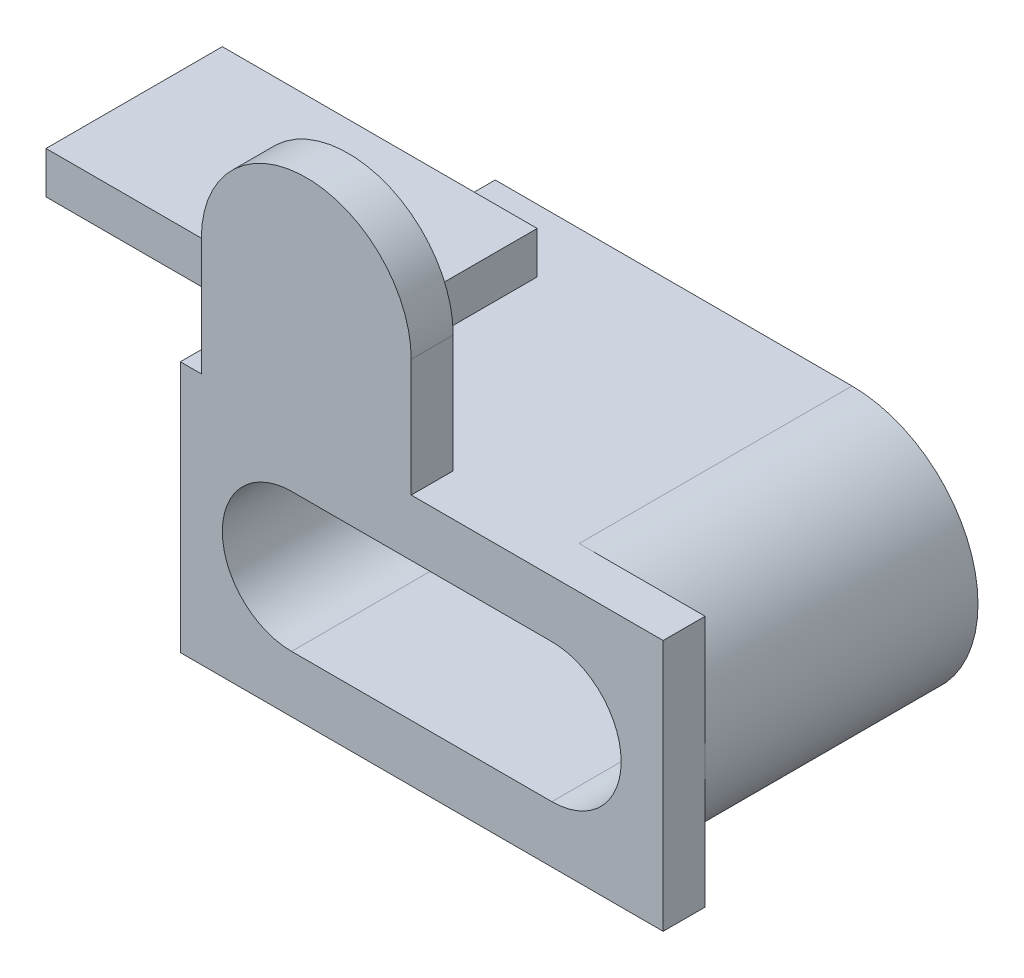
from build123d import *

# Parameters (mm, degrees)
AUFSATZ_LINEAR_AUSTRAGEN1_DEPTH = 7.5
SKIZZE3_W                       = 6.5
SKIZZE3_H                       = 5.3
SCHNITT_LINEAR_AUSTRAGEN1_DEPTH = 13.593151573
SCHNITT_LINEAR_AUSTRAGEN5_DEPTH = 6.5
AUFSATZ_LINEAR_AUSTRAGEN4_DEPTH = 6.5
AUFSATZ_LINEAR_AUSTRAGEN5_DEPTH = 1


with BuildPart() as part:
    # Skizze1 → Aufsatz-Linear austragen1 (new body)
    with BuildSketch(Plane.XY):
        with BuildLine():
            Line((1.745294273, 2.844781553), (7.745294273, 2.844781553))
            Line((7.745294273, 2.844781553), (7.745294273, -3.155218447))
            Line((7.745294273, -3.155218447), (-3.754705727, -3.155218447))
            Line((-3.754705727, -3.155218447), (-3.754705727, 2.844781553))
            Line((-3.754705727, 2.844781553), (-3.254705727, 2.844781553))
            Line((-3.254705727, 2.844781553), (-3.254705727, 5.644781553))
            ThreePointArc((-3.254705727, 5.644781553), (-0.754705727, 8.144781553), (1.745294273, 5.644781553))
            Line((1.745294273, 5.644781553), (1.745294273, 2.844781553))
        make_face()
        with BuildLine():
            Line((-1.104705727, 1.494781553), (5.095294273, 1.494781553))
            ThreePointArc((5.095294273, 1.494781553), (6.745294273, -0.155218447), (5.095294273, -1.805218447))
            Line((5.095294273, -1.805218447), (-1.104705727, -1.805218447))
            ThreePointArc((-1.104705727, -1.805218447), (-2.754705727, -0.155218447), (-1.104705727, 1.494781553))
        make_face(mode=Mode.SUBTRACT)
    extrude(amount=AUFSATZ_LINEAR_AUSTRAGEN1_DEPTH)

    # Skizze3 → Schnitt-Linear austragen1 (cut, through all)
    with BuildSketch(Plane(origin=(1.745294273, 0, 0), x_dir=(0, 0, -1), z_dir=(1, 0, 0))):
        with Locations((-3.25, 5.494781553)):
            Rectangle(SKIZZE3_W, SKIZZE3_H)
    extrude(amount=-SCHNITT_LINEAR_AUSTRAGEN1_DEPTH, mode=Mode.SUBTRACT)

    # Skizze8 → Schnitt-Linear austragen5 (cut)
    with BuildSketch(Plane(origin=(0, 0, 0), x_dir=(-1, 0, 0), z_dir=(0, 0, -1))):
        with BuildLine():
            ThreePointArc((-7.745294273, -0.155218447), (-6.866614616, 1.966101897), (-4.745294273, 2.844781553))
            Line((-4.745294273, 2.844781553), (-7.745294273, 2.844781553))
            Line((-7.745294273, 2.844781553), (-7.745294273, -0.155218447))
        make_face()
        with BuildLine():
            ThreePointArc((-4.745294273, -3.155218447), (-6.866614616, -2.27653879), (-7.745294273, -0.155218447))
            Line((-7.745294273, -0.155218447), (-7.745294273, -3.155218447))
            Line((-7.745294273, -3.155218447), (-4.745294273, -3.155218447))
        make_face()
        with BuildLine():
            Line((3.754705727, 2.844781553), (0.754705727, 2.844781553))
            ThreePointArc((0.754705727, 2.844781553), (2.876026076, 1.966101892), (3.754705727, -0.155218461))
            Line((3.754705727, -0.155218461), (3.754705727, 2.844781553))
        make_face()
        with BuildLine():
            Line((3.754705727, -3.155218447), (3.754705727, -0.155218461))
            ThreePointArc((3.754705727, -0.155218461), (2.876026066, -2.276538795), (0.754705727, -3.155218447))
            Line((0.754705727, -3.155218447), (3.754705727, -3.155218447))
        make_face()
    extrude(amount=-SCHNITT_LINEAR_AUSTRAGEN5_DEPTH, mode=Mode.SUBTRACT)

    # Skizze9 → Aufsatz-Linear austragen4 (add)
    with BuildSketch(Plane(origin=(0, 0, 0), x_dir=(-1, 0, 0), z_dir=(0, 0, -1))):
        with BuildLine():
            Line((3.754705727, -0.155218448), (3.754705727, 2.844781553))
            Line((3.754705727, 2.844781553), (0.754705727, 2.844781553))
            ThreePointArc((0.754705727, 2.844781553), (2.876026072, 1.966101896), (3.754705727, -0.155218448))
        make_face()
        with BuildLine():
            Line((3.754705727, -3.155218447), (3.754705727, -0.155218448))
            ThreePointArc((3.754705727, -0.155218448), (2.87602607, -2.276538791), (0.754705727, -3.155218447))
            Line((0.754705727, -3.155218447), (3.754705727, -3.155218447))
        make_face()
    extrude(amount=-AUFSATZ_LINEAR_AUSTRAGEN4_DEPTH)

    # Skizze10 → Aufsatz-Linear austragen5 (add)
    with BuildSketch(Plane(origin=(0, 2.844781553, 0), x_dir=(1, 0, 0), z_dir=(0, 1, 0))):
        Polygon((-1.254705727, -6.5), (-3.754705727, -6.5), (-3.754705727, -5.7), (-8.754705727, -5.7), (-8.754705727, -1.5), (-1.254705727, -1.5), align=None)
    extrude(amount=AUFSATZ_LINEAR_AUSTRAGEN5_DEPTH)


solid = part.part
